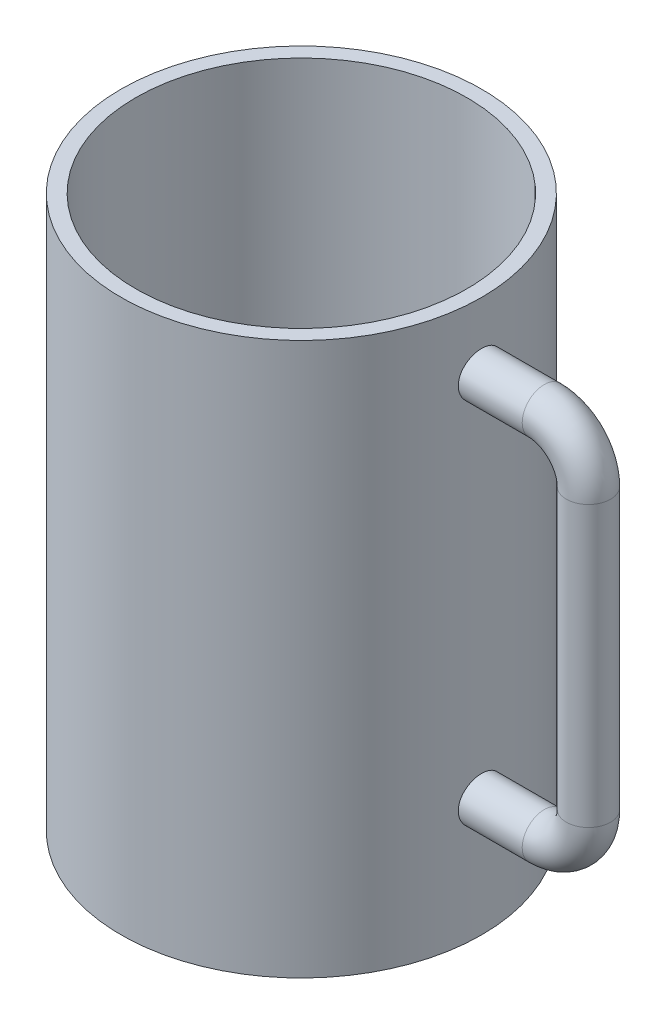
ISO-10303-21;
HEADER;
FILE_DESCRIPTION(('STEP AP214'),'2;1');
FILE_NAME('part.step','',(''),(''),'','','');
FILE_SCHEMA(('AUTOMOTIVE_DESIGN { 1 0 10303 214 1 1 1 1 }'));
ENDSEC;
DATA;
#1=APPLICATION_CONTEXT('core data for automotive mechanical design processes');
#2=APPLICATION_PROTOCOL_DEFINITION('international standard','automotive_design',2000,#1);
#3=PRODUCT_CONTEXT('',#1,'mechanical');
#4=PRODUCT('Part','Part','',(#3));
#5=PRODUCT_RELATED_PRODUCT_CATEGORY('part','',(#4));
#6=PRODUCT_DEFINITION_FORMATION('','',#4);
#7=PRODUCT_DEFINITION_CONTEXT('part definition',#1,'design');
#8=PRODUCT_DEFINITION('design','',#6,#7);
#9=PRODUCT_DEFINITION_SHAPE('','',#8);
#10=(LENGTH_UNIT() NAMED_UNIT(*) SI_UNIT(.MILLI.,.METRE.));
#11=(NAMED_UNIT(*) PLANE_ANGLE_UNIT() SI_UNIT($,.RADIAN.));
#12=(NAMED_UNIT(*) SI_UNIT($,.STERADIAN.) SOLID_ANGLE_UNIT());
#13=UNCERTAINTY_MEASURE_WITH_UNIT(LENGTH_MEASURE(1.E-05),#10,'distance_accuracy_value','');
#14=(GEOMETRIC_REPRESENTATION_CONTEXT(3) GLOBAL_UNCERTAINTY_ASSIGNED_CONTEXT((#13)) GLOBAL_UNIT_ASSIGNED_CONTEXT((#10,
#11,#12)) REPRESENTATION_CONTEXT('',''));
#15=CARTESIAN_POINT('',(0.,0.,0.));
#16=DIRECTION('',(0.,0.,1.));
#17=DIRECTION('',(1.,0.,0.));
#18=AXIS2_PLACEMENT_3D('',#15,#16,#17);
#19=CARTESIAN_POINT('',(10.,-12.,0.));
#20=DIRECTION('',(0.,1.,0.));
#21=DIRECTION('',(-1.,0.,0.));
#22=AXIS2_PLACEMENT_3D('',#19,#20,#21);
#23=CYLINDRICAL_SURFACE('',#22,49.);
#24=CARTESIAN_POINT('',(59.,6.00000000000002,0.));
#25=CARTESIAN_POINT('',(59.0000006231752,5.99999810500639,0.167896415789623));
#26=CARTESIAN_POINT('',(58.9991353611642,6.00704983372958,0.335764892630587));
#27=CARTESIAN_POINT('',(58.9956998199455,6.0352027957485,0.670355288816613));
#28=CARTESIAN_POINT('',(58.9931291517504,6.05630723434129,0.837076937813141));
#29=CARTESIAN_POINT('',(58.9863516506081,6.11243508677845,1.16825140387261));
#30=CARTESIAN_POINT('',(58.9821435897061,6.14746894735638,1.33270242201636));
#31=CARTESIAN_POINT('',(58.9722084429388,6.23121089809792,1.6581031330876));
#32=CARTESIAN_POINT('',(58.9664808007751,6.27992399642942,1.81905152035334));
#33=CARTESIAN_POINT('',(58.9536751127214,6.39060407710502,2.1360800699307));
#34=CARTESIAN_POINT('',(58.9465984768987,6.45255722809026,2.29216511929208));
#35=CARTESIAN_POINT('',(58.9312865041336,6.58932393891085,2.59860492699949));
#36=CARTESIAN_POINT('',(58.923050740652,6.66414223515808,2.74895754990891));
#37=CARTESIAN_POINT('',(58.9056577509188,6.82604306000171,3.04274296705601));
#38=CARTESIAN_POINT('',(58.8965010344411,6.91311881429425,3.1861795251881));
#39=CARTESIAN_POINT('',(58.87751434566,7.09898433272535,3.46528019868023));
#40=CARTESIAN_POINT('',(58.8676841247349,7.19777843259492,3.60094140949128));
#41=CARTESIAN_POINT('',(58.8475839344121,7.40681779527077,3.86406954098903));
#42=CARTESIAN_POINT('',(58.8373122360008,7.51711106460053,3.99149819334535));
#43=CARTESIAN_POINT('',(58.8166546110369,7.74805974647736,4.23667043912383));
#44=CARTESIAN_POINT('',(58.806268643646,7.86871897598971,4.35441043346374));
#45=CARTESIAN_POINT('',(58.7856824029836,8.11948291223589,4.57929490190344));
#46=CARTESIAN_POINT('',(58.7754820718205,8.24958460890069,4.68644272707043));
#47=CARTESIAN_POINT('',(58.7555483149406,8.51841094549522,4.88947037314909));
#48=CARTESIAN_POINT('',(58.7458150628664,8.6571387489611,4.98534602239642));
#49=CARTESIAN_POINT('',(58.7270690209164,8.94261658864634,5.16536176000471));
#50=CARTESIAN_POINT('',(58.7180583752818,9.08938847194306,5.249467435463));
#51=CARTESIAN_POINT('',(58.701043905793,9.38960715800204,5.40503915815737));
#52=CARTESIAN_POINT('',(58.6930404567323,9.54305641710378,5.47650050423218));
#53=CARTESIAN_POINT('',(58.6782786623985,9.85544525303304,5.60619831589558));
#54=CARTESIAN_POINT('',(58.6715198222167,10.0143826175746,5.66444004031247));
#55=CARTESIAN_POINT('',(58.6594352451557,10.3366703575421,5.76732210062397));
#56=CARTESIAN_POINT('',(58.6541100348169,10.500022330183,5.81195743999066));
#57=CARTESIAN_POINT('',(58.6405868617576,10.9931786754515,5.92446822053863));
#58=CARTESIAN_POINT('',(58.6347472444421,11.3280145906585,5.97174750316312));
#59=CARTESIAN_POINT('',(58.6301003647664,12.0007327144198,6.00946361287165));
#60=CARTESIAN_POINT('',(58.6312928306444,12.3386148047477,5.99990263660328));
#61=CARTESIAN_POINT('',(58.6405338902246,13.0061072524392,5.92451461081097));
#62=CARTESIAN_POINT('',(58.648544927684,13.335752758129,5.85899576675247));
#63=CARTESIAN_POINT('',(58.6704651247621,13.9793215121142,5.67401262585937));
#64=CARTESIAN_POINT('',(58.6843743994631,14.2932444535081,5.55454727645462));
#65=CARTESIAN_POINT('',(58.7165656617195,14.8974323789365,5.26473526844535));
#66=CARTESIAN_POINT('',(58.7348591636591,15.1876323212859,5.09425432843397));
#67=CARTESIAN_POINT('',(58.7737489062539,15.7354195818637,4.70734515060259));
#68=CARTESIAN_POINT('',(58.79434524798,15.9930054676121,4.49091489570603));
#69=CARTESIAN_POINT('',(58.8356869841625,16.4700434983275,4.01654107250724));
#70=CARTESIAN_POINT('',(58.8564324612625,16.6892314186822,3.7583317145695));
#71=CARTESIAN_POINT('',(58.8956070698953,17.0811950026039,3.20864521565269));
#72=CARTESIAN_POINT('',(58.9140361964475,17.2539705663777,2.91716800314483));
#73=CARTESIAN_POINT('',(58.9465124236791,17.5482040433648,2.30901834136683));
#74=CARTESIAN_POINT('',(58.9605581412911,17.6696457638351,1.99233797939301));
#75=CARTESIAN_POINT('',(58.9826722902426,17.8575562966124,1.34287005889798));
#76=CARTESIAN_POINT('',(58.9907409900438,17.9240275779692,1.01008322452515));
#77=CARTESIAN_POINT('',(58.9999571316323,17.9997687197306,0.340133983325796));
#78=CARTESIAN_POINT('',(59.0011486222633,18.0094026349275,0.00301331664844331));
#79=CARTESIAN_POINT('',(58.9965949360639,17.9721557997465,-0.668037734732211));
#80=CARTESIAN_POINT('',(58.9908499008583,17.9252762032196,-1.00196818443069));
#81=CARTESIAN_POINT('',(58.9730962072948,17.7766355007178,-1.65608816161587));
#82=CARTESIAN_POINT('',(58.9611073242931,17.6750476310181,-1.9763176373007));
#83=CARTESIAN_POINT('',(58.9322084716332,17.4200538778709,-2.59519442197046));
#84=CARTESIAN_POINT('',(58.9152983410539,17.2666462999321,-2.89384102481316));
#85=CARTESIAN_POINT('',(58.8783331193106,16.9114848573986,-3.46270276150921));
#86=CARTESIAN_POINT('',(58.8582628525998,16.7094950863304,-3.73276960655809));
#87=CARTESIAN_POINT('',(58.8172709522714,16.263236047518,-4.23529766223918));
#88=CARTESIAN_POINT('',(58.7963492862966,16.018965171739,-4.46775744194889));
#89=CARTESIAN_POINT('',(58.7558769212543,15.4934804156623,-4.88976170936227));
#90=CARTESIAN_POINT('',(58.7363343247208,15.2120722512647,-5.07906513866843));
#91=CARTESIAN_POINT('',(58.7009655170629,14.6212287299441,-5.40771700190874));
#92=CARTESIAN_POINT('',(58.6851392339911,14.3117939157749,-5.5470664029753));
#93=CARTESIAN_POINT('',(58.6590478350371,13.6745272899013,-5.77146899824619));
#94=CARTESIAN_POINT('',(58.6487687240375,13.3467441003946,-5.85665893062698));
#95=CARTESIAN_POINT('',(58.6349019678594,12.6812063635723,-5.97074217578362));
#96=CARTESIAN_POINT('',(58.6313140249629,12.3434522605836,-5.99963799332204));
#97=CARTESIAN_POINT('',(58.6312421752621,11.8382471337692,-6.00017546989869));
#98=CARTESIAN_POINT('',(58.6320934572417,11.6705527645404,-5.99329912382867));
#99=CARTESIAN_POINT('',(58.6355076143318,11.3363619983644,-5.96553784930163));
#100=CARTESIAN_POINT('',(58.6380698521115,11.169865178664,-5.94465813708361));
#101=CARTESIAN_POINT('',(58.6448364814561,10.839189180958,-5.88902833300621));
#102=CARTESIAN_POINT('',(58.6490414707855,10.6750108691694,-5.85427319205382));
#103=CARTESIAN_POINT('',(58.6589701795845,10.3502401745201,-5.77116738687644));
#104=CARTESIAN_POINT('',(58.6646933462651,10.1896465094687,-5.722821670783));
#105=CARTESIAN_POINT('',(58.6774961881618,9.87311291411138,-5.61288018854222));
#106=CARTESIAN_POINT('',(58.6845759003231,9.71717311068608,-5.55128406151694));
#107=CARTESIAN_POINT('',(58.6998877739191,9.41109566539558,-5.4153122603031));
#108=CARTESIAN_POINT('',(58.7081195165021,9.26095593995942,-5.34094122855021));
#109=CARTESIAN_POINT('',(58.7255081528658,8.96740645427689,-5.17990471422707));
#110=CARTESIAN_POINT('',(58.734665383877,8.82399917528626,-5.09323474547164));
#111=CARTESIAN_POINT('',(58.7536415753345,8.5450134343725,-4.90826545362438));
#112=CARTESIAN_POINT('',(58.763460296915,8.40943217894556,-4.8099703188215));
#113=CARTESIAN_POINT('',(58.7835556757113,8.14608489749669,-4.60170728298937));
#114=CARTESIAN_POINT('',(58.793834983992,8.01837802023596,-4.49166483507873));
#115=CARTESIAN_POINT('',(58.8144947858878,7.772721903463,-4.26127521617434));
#116=CARTESIAN_POINT('',(58.8248752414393,7.65476914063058,-4.14093179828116));
#117=CARTESIAN_POINT('',(58.8454549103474,7.42932417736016,-3.89066879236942));
#118=CARTESIAN_POINT('',(58.8556540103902,7.32183834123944,-3.76074346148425));
#119=CARTESIAN_POINT('',(58.8755735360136,7.11820152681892,-3.49233604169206));
#120=CARTESIAN_POINT('',(58.885294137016,7.02204637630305,-3.35385713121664));
#121=CARTESIAN_POINT('',(58.9040248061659,6.84134178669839,-3.06868916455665));
#122=CARTESIAN_POINT('',(58.9130318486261,6.75684074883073,-2.92196923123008));
#123=CARTESIAN_POINT('',(58.9300325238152,6.60054463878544,-2.62192418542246));
#124=CARTESIAN_POINT('',(58.9380265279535,6.5287449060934,-2.46860152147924));
#125=CARTESIAN_POINT('',(58.95277171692,6.39838821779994,-2.15650595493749));
#126=CARTESIAN_POINT('',(58.9595238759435,6.33982087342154,-1.99773744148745));
#127=CARTESIAN_POINT('',(58.9715995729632,6.2363032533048,-1.67582486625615));
#128=CARTESIAN_POINT('',(58.9769234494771,6.1913497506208,-1.51268185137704));
#129=CARTESIAN_POINT('',(58.9875304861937,6.10247996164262,-1.12717683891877));
#130=CARTESIAN_POINT('',(58.9921871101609,6.06408923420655,-0.903500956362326));
#131=CARTESIAN_POINT('',(58.998421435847,6.01285062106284,-0.453199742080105));
#132=CARTESIAN_POINT('',(58.9999991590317,6.00000255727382,-0.226574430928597));
#133=CARTESIAN_POINT('',(59.,6.00000000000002,0.));
#134=B_SPLINE_CURVE_WITH_KNOTS('',3,(#24,#25,#26,#27,#28,#29,#30,#31,#32,#33,#34,#35,#36,#37,
#38,#39,#40,#41,#42,#43,#44,#45,#46,#47,#48,#49,#50,#51,#52,#53,#54,#55,#56,#57,#58,#59,#60,#61,
#62,#63,#64,#65,#66,#67,#68,#69,#70,#71,#72,#73,#74,#75,#76,#77,#78,#79,#80,#81,#82,#83,#84,#85,
#86,#87,#88,#89,#90,#91,#92,#93,#94,#95,#96,#97,#98,#99,#100,#101,#102,#103,#104,#105,#106,#107,
#108,#109,#110,#111,#112,#113,#114,#115,#116,#117,#118,#119,#120,#121,#122,#123,#124,#125,#126,
#127,#128,#129,#130,#131,#132,#133),.UNSPECIFIED.,.T.,.F.,(4,2,2,2,2,2,2,2,2,2,2,2,2,2,2,2,2,2,
2,2,2,2,2,2,2,2,2,2,2,2,2,2,2,2,2,2,2,2,2,2,2,2,2,2,2,2,2,2,2,2,2,2,2,2,4),(0.,
0.503490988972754,1.00709685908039,1.51108113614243,2.01525017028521,2.51889507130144,
3.02272579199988,3.52627914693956,4.03001939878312,4.53595393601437,5.04207557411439,
5.54803657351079,6.0541842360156,6.56178215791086,7.06956840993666,7.57715230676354,
8.08492237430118,9.09426654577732,10.103571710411,11.1073533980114,12.1111546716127,
13.1176217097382,14.1241329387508,15.1373191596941,16.1505075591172,17.1640153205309,
18.1774775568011,19.1844412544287,20.1913843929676,21.195157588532,22.198963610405,
23.2077460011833,24.2165667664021,25.2308914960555,26.2451965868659,27.2569305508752,
28.2686194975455,28.7716422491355,29.2744777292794,29.777496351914,30.2803320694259,
30.7831814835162,31.2858485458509,31.7886994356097,32.2913697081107,32.7974443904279,
33.303335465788,33.8095322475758,34.3155420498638,34.8235938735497,35.3314588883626,
35.8389237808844,36.3462682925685,37.0257287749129,37.7051845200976),.UNSPECIFIED.);
#135=CARTESIAN_POINT('',(59.,6.00000000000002,0.));
#136=VERTEX_POINT('',#135);
#137=EDGE_CURVE('E33',#136,#136,#134,.T.);
#138=ORIENTED_EDGE('',*,*,#137,.T.);
#139=EDGE_LOOP('',(#138));
#140=FACE_BOUND('',#139,.T.);
#141=CARTESIAN_POINT('',(10.,-20.,0.));
#142=DIRECTION('',(0.,1.,0.));
#143=DIRECTION('',(-1.,0.,0.));
#144=AXIS2_PLACEMENT_3D('',#141,#142,#143);
#145=CIRCLE('',#144,49.);
#146=CARTESIAN_POINT('',(-39.,-20.,0.));
#147=VERTEX_POINT('',#146);
#148=EDGE_CURVE('E41',#147,#147,#145,.T.);
#149=ORIENTED_EDGE('',*,*,#148,.T.);
#150=EDGE_LOOP('',(#149));
#151=FACE_BOUND('',#150,.T.);
#152=CARTESIAN_POINT('',(9.99999999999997,130.,0.));
#153=DIRECTION('',(0.,1.,0.));
#154=DIRECTION('',(-1.,0.,0.));
#155=AXIS2_PLACEMENT_3D('',#152,#153,#154);
#156=CIRCLE('',#155,49.);
#157=CARTESIAN_POINT('',(-39.,130.,0.));
#158=VERTEX_POINT('',#157);
#159=EDGE_CURVE('E45',#158,#158,#156,.T.);
#160=ORIENTED_EDGE('',*,*,#159,.F.);
#161=EDGE_LOOP('',(#160));
#162=FACE_BOUND('',#161,.T.);
#163=CARTESIAN_POINT('',(59.,106.,0.));
#164=CARTESIAN_POINT('',(59.0000006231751,105.999998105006,-0.167896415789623));
#165=CARTESIAN_POINT('',(58.9991353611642,106.00704983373,-0.335764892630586));
#166=CARTESIAN_POINT('',(58.9956998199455,106.035202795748,-0.670355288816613));
#167=CARTESIAN_POINT('',(58.9931291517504,106.056307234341,-0.837076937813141));
#168=CARTESIAN_POINT('',(58.9863516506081,106.112435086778,-1.16825140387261));
#169=CARTESIAN_POINT('',(58.9821435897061,106.147468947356,-1.33270242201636));
#170=CARTESIAN_POINT('',(58.9722084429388,106.231210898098,-1.6581031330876));
#171=CARTESIAN_POINT('',(58.9664808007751,106.279923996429,-1.81905152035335));
#172=CARTESIAN_POINT('',(58.9536751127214,106.390604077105,-2.1360800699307));
#173=CARTESIAN_POINT('',(58.9465984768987,106.45255722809,-2.29216511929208));
#174=CARTESIAN_POINT('',(58.9312865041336,106.589323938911,-2.59860492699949));
#175=CARTESIAN_POINT('',(58.923050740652,106.664142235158,-2.74895754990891));
#176=CARTESIAN_POINT('',(58.9056577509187,106.826043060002,-3.04274296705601));
#177=CARTESIAN_POINT('',(58.8965010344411,106.913118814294,-3.1861795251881));
#178=CARTESIAN_POINT('',(58.8775143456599,107.098984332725,-3.46528019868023));
#179=CARTESIAN_POINT('',(58.8676841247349,107.197778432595,-3.60094140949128));
#180=CARTESIAN_POINT('',(58.847583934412,107.406817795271,-3.86406954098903));
#181=CARTESIAN_POINT('',(58.8373122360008,107.5171110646,-3.99149819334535));
#182=CARTESIAN_POINT('',(58.8166546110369,107.748059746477,-4.23667043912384));
#183=CARTESIAN_POINT('',(58.806268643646,107.86871897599,-4.35441043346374));
#184=CARTESIAN_POINT('',(58.7856824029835,108.119482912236,-4.57929490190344));
#185=CARTESIAN_POINT('',(58.7754820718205,108.249584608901,-4.68644272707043));
#186=CARTESIAN_POINT('',(58.7555483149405,108.518410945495,-4.88947037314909));
#187=CARTESIAN_POINT('',(58.7458150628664,108.657138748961,-4.98534602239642));
#188=CARTESIAN_POINT('',(58.7270690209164,108.942616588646,-5.16536176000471));
#189=CARTESIAN_POINT('',(58.7180583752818,109.089388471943,-5.24946743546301));
#190=CARTESIAN_POINT('',(58.701043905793,109.389607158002,-5.40503915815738));
#191=CARTESIAN_POINT('',(58.6930404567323,109.543056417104,-5.47650050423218));
#192=CARTESIAN_POINT('',(58.6782786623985,109.855445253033,-5.60619831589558));
#193=CARTESIAN_POINT('',(58.6715198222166,110.014382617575,-5.66444004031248));
#194=CARTESIAN_POINT('',(58.6594352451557,110.336670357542,-5.76732210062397));
#195=CARTESIAN_POINT('',(58.6541100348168,110.500022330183,-5.81195743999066));
#196=CARTESIAN_POINT('',(58.6405868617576,110.993178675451,-5.92446822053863));
#197=CARTESIAN_POINT('',(58.6347472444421,111.328014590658,-5.97174750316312));
#198=CARTESIAN_POINT('',(58.6301003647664,112.00073271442,-6.00946361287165));
#199=CARTESIAN_POINT('',(58.6312928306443,112.338614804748,-5.99990263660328));
#200=CARTESIAN_POINT('',(58.6405338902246,113.006107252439,-5.92451461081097));
#201=CARTESIAN_POINT('',(58.648544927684,113.335752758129,-5.85899576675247));
#202=CARTESIAN_POINT('',(58.6704651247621,113.979321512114,-5.67401262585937));
#203=CARTESIAN_POINT('',(58.6843743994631,114.293244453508,-5.55454727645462));
#204=CARTESIAN_POINT('',(58.7165656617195,114.897432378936,-5.26473526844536));
#205=CARTESIAN_POINT('',(58.7348591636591,115.187632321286,-5.09425432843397));
#206=CARTESIAN_POINT('',(58.7737489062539,115.735419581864,-4.70734515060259));
#207=CARTESIAN_POINT('',(58.7943452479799,115.993005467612,-4.49091489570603));
#208=CARTESIAN_POINT('',(58.8356869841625,116.470043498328,-4.01654107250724));
#209=CARTESIAN_POINT('',(58.8564324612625,116.689231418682,-3.7583317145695));
#210=CARTESIAN_POINT('',(58.8956070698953,117.081195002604,-3.20864521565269));
#211=CARTESIAN_POINT('',(58.9140361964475,117.253970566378,-2.91716800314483));
#212=CARTESIAN_POINT('',(58.946512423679,117.548204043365,-2.30901834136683));
#213=CARTESIAN_POINT('',(58.9605581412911,117.669645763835,-1.99233797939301));
#214=CARTESIAN_POINT('',(58.9826722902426,117.857556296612,-1.34287005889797));
#215=CARTESIAN_POINT('',(58.9907409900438,117.924027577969,-1.01008322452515));
#216=CARTESIAN_POINT('',(58.9999571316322,117.999768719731,-0.34013398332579));
#217=CARTESIAN_POINT('',(59.0011486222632,118.009402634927,-0.00301331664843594));
#218=CARTESIAN_POINT('',(58.9965949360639,117.972155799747,0.668037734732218));
#219=CARTESIAN_POINT('',(58.9908499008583,117.92527620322,1.00196818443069));
#220=CARTESIAN_POINT('',(58.9730962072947,117.776635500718,1.65608816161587));
#221=CARTESIAN_POINT('',(58.9611073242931,117.675047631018,1.9763176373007));
#222=CARTESIAN_POINT('',(58.9322084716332,117.420053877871,2.59519442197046));
#223=CARTESIAN_POINT('',(58.9152983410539,117.266646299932,2.89384102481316));
#224=CARTESIAN_POINT('',(58.8783331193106,116.911484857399,3.46270276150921));
#225=CARTESIAN_POINT('',(58.8582628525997,116.70949508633,3.73276960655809));
#226=CARTESIAN_POINT('',(58.8172709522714,116.263236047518,4.23529766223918));
#227=CARTESIAN_POINT('',(58.7963492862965,116.018965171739,4.46775744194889));
#228=CARTESIAN_POINT('',(58.7558769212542,115.493480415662,4.88976170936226));
#229=CARTESIAN_POINT('',(58.7363343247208,115.212072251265,5.07906513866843));
#230=CARTESIAN_POINT('',(58.7009655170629,114.621228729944,5.40771700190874));
#231=CARTESIAN_POINT('',(58.6851392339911,114.311793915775,5.5470664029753));
#232=CARTESIAN_POINT('',(58.6590478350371,113.674527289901,5.77146899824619));
#233=CARTESIAN_POINT('',(58.6487687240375,113.346744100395,5.85665893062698));
#234=CARTESIAN_POINT('',(58.6349019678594,112.681206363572,5.97074217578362));
#235=CARTESIAN_POINT('',(58.6313140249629,112.343452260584,5.99963799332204));
#236=CARTESIAN_POINT('',(58.6312421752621,111.838247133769,6.00017546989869));
#237=CARTESIAN_POINT('',(58.6320934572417,111.67055276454,5.99329912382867));
#238=CARTESIAN_POINT('',(58.6355076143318,111.336361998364,5.96553784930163));
#239=CARTESIAN_POINT('',(58.6380698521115,111.169865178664,5.94465813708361));
#240=CARTESIAN_POINT('',(58.6448364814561,110.839189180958,5.88902833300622));
#241=CARTESIAN_POINT('',(58.6490414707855,110.675010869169,5.85427319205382));
#242=CARTESIAN_POINT('',(58.6589701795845,110.35024017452,5.77116738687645));
#243=CARTESIAN_POINT('',(58.6646933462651,110.189646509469,5.722821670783));
#244=CARTESIAN_POINT('',(58.6774961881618,109.873112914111,5.61288018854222));
#245=CARTESIAN_POINT('',(58.684575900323,109.717173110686,5.55128406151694));
#246=CARTESIAN_POINT('',(58.6998877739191,109.411095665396,5.4153122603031));
#247=CARTESIAN_POINT('',(58.7081195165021,109.260955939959,5.3409412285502));
#248=CARTESIAN_POINT('',(58.7255081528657,108.967406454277,5.17990471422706));
#249=CARTESIAN_POINT('',(58.734665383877,108.823999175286,5.09323474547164));
#250=CARTESIAN_POINT('',(58.7536415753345,108.545013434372,4.90826545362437));
#251=CARTESIAN_POINT('',(58.763460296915,108.409432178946,4.80997031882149));
#252=CARTESIAN_POINT('',(58.7835556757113,108.146084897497,4.60170728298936));
#253=CARTESIAN_POINT('',(58.793834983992,108.018378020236,4.49166483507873));
#254=CARTESIAN_POINT('',(58.8144947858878,107.772721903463,4.26127521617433));
#255=CARTESIAN_POINT('',(58.8248752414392,107.654769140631,4.14093179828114));
#256=CARTESIAN_POINT('',(58.8454549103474,107.42932417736,3.8906687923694));
#257=CARTESIAN_POINT('',(58.8556540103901,107.321838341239,3.76074346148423));
#258=CARTESIAN_POINT('',(58.8755735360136,107.118201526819,3.49233604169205));
#259=CARTESIAN_POINT('',(58.885294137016,107.022046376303,3.35385713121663));
#260=CARTESIAN_POINT('',(58.9040248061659,106.841341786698,3.06868916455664));
#261=CARTESIAN_POINT('',(58.9130318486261,106.756840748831,2.92196923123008));
#262=CARTESIAN_POINT('',(58.9300325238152,106.600544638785,2.62192418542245));
#263=CARTESIAN_POINT('',(58.9380265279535,106.528744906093,2.46860152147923));
#264=CARTESIAN_POINT('',(58.95277171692,106.3983882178,2.15650595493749));
#265=CARTESIAN_POINT('',(58.9595238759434,106.339820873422,1.99773744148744));
#266=CARTESIAN_POINT('',(58.9715995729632,106.236303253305,1.67582486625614));
#267=CARTESIAN_POINT('',(58.976923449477,106.191349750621,1.51268185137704));
#268=CARTESIAN_POINT('',(58.9875304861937,106.102479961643,1.12717683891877));
#269=CARTESIAN_POINT('',(58.9921871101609,106.064089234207,0.903500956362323));
#270=CARTESIAN_POINT('',(58.998421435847,106.012850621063,0.453199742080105));
#271=CARTESIAN_POINT('',(58.9999991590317,106.000002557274,0.226574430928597));
#272=CARTESIAN_POINT('',(59.,106.,0.));
#273=B_SPLINE_CURVE_WITH_KNOTS('',3,(#163,#164,#165,#166,#167,#168,#169,#170,#171,#172,#173,
#174,#175,#176,#177,#178,#179,#180,#181,#182,#183,#184,#185,#186,#187,#188,#189,#190,#191,#192,
#193,#194,#195,#196,#197,#198,#199,#200,#201,#202,#203,#204,#205,#206,#207,#208,#209,#210,#211,
#212,#213,#214,#215,#216,#217,#218,#219,#220,#221,#222,#223,#224,#225,#226,#227,#228,#229,#230,
#231,#232,#233,#234,#235,#236,#237,#238,#239,#240,#241,#242,#243,#244,#245,#246,#247,#248,#249,
#250,#251,#252,#253,#254,#255,#256,#257,#258,#259,#260,#261,#262,#263,#264,#265,#266,#267,#268,
#269,#270,#271,#272),.UNSPECIFIED.,.T.,.F.,(4,2,2,2,2,2,2,2,2,2,2,2,2,2,2,2,2,2,2,2,2,2,2,2,2,2,
2,2,2,2,2,2,2,2,2,2,2,2,2,2,2,2,2,2,2,2,2,2,2,2,2,2,2,2,4),(0.,0.503490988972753,
1.00709685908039,1.51108113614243,2.01525017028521,2.51889507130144,3.02272579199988,
3.52627914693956,4.03001939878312,4.53595393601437,5.04207557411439,5.54803657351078,
6.05418423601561,6.56178215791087,7.06956840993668,7.57715230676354,8.08492237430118,
9.09426654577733,10.103571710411,11.1073533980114,12.1111546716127,13.1176217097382,
14.1241329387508,15.1373191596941,16.1505075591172,17.1640153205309,18.1774775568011,
19.1844412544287,20.1913843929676,21.195157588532,22.198963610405,23.2077460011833,
24.2165667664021,25.2308914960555,26.2451965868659,27.2569305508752,28.2686194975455,
28.7716422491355,29.2744777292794,29.7774963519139,30.2803320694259,30.7831814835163,
31.2858485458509,31.7886994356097,32.2913697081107,32.7974443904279,33.3033354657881,
33.8095322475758,34.3155420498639,34.8235938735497,35.3314588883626,35.8389237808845,
36.3462682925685,37.0257287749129,37.7051845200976),.UNSPECIFIED.);
#274=CARTESIAN_POINT('',(59.,106.,0.));
#275=VERTEX_POINT('',#274);
#276=EDGE_CURVE('E10',#275,#275,#273,.T.);
#277=ORIENTED_EDGE('',*,*,#276,.F.);
#278=EDGE_LOOP('',(#277));
#279=FACE_BOUND('',#278,.T.);
#280=ADVANCED_FACE('F29',(#140,#151,#162,#279),#23,.T.);
#281=CARTESIAN_POINT('',(55.,-12.,0.));
#282=DIRECTION('',(0.,-1.,0.));
#283=DIRECTION('',(1.,0.,0.));
#284=AXIS2_PLACEMENT_3D('',#281,#282,#283);
#285=PLANE('',#284);
#286=CARTESIAN_POINT('',(10.,-12.,0.));
#287=DIRECTION('',(0.,1.,0.));
#288=DIRECTION('',(-1.,0.,0.));
#289=AXIS2_PLACEMENT_3D('',#286,#287,#288);
#290=CIRCLE('',#289,45.);
#291=CARTESIAN_POINT('',(-35.,-12.,0.));
#292=VERTEX_POINT('',#291);
#293=EDGE_CURVE('E103',#292,#292,#290,.T.);
#294=ORIENTED_EDGE('',*,*,#293,.T.);
#295=EDGE_LOOP('',(#294));
#296=FACE_BOUND('',#295,.T.);
#297=ADVANCED_FACE('F31',(#296),#285,.F.);
#298=CARTESIAN_POINT('',(10.,-20.,0.));
#299=DIRECTION('',(0.,1.,0.));
#300=DIRECTION('',(-1.,0.,0.));
#301=AXIS2_PLACEMENT_3D('',#298,#299,#300);
#302=PLANE('',#301);
#303=ORIENTED_EDGE('',*,*,#148,.F.);
#304=EDGE_LOOP('',(#303));
#305=FACE_BOUND('',#304,.T.);
#306=ADVANCED_FACE('F79',(#305),#302,.F.);
#307=CARTESIAN_POINT('',(59.,130.,0.));
#308=DIRECTION('',(0.,-1.,0.));
#309=DIRECTION('',(1.,0.,0.));
#310=AXIS2_PLACEMENT_3D('',#307,#308,#309);
#311=PLANE('',#310);
#312=CARTESIAN_POINT('',(9.99999999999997,130.,0.));
#313=DIRECTION('',(0.,1.,0.));
#314=DIRECTION('',(-1.,0.,0.));
#315=AXIS2_PLACEMENT_3D('',#312,#313,#314);
#316=CIRCLE('',#315,45.);
#317=CARTESIAN_POINT('',(-35.,130.,0.));
#318=VERTEX_POINT('',#317);
#319=EDGE_CURVE('E101',#318,#318,#316,.T.);
#320=ORIENTED_EDGE('',*,*,#319,.F.);
#321=EDGE_LOOP('',(#320));
#322=FACE_BOUND('',#321,.T.);
#323=ORIENTED_EDGE('',*,*,#159,.T.);
#324=EDGE_LOOP('',(#323));
#325=FACE_BOUND('',#324,.T.);
#326=ADVANCED_FACE('F76',(#322,#325),#311,.F.);
#327=CARTESIAN_POINT('',(10.,-12.,0.));
#328=DIRECTION('',(0.,1.,0.));
#329=DIRECTION('',(-1.,0.,0.));
#330=AXIS2_PLACEMENT_3D('',#327,#328,#329);
#331=CYLINDRICAL_SURFACE('',#330,45.);
#332=ORIENTED_EDGE('',*,*,#293,.F.);
#333=EDGE_LOOP('',(#332));
#334=FACE_BOUND('',#333,.T.);
#335=ORIENTED_EDGE('',*,*,#319,.T.);
#336=EDGE_LOOP('',(#335));
#337=FACE_BOUND('',#336,.T.);
#338=ADVANCED_FACE('F73',(#334,#337),#331,.F.);
#339=CARTESIAN_POINT('',(76.,12.,0.));
#340=DIRECTION('',(-1.,0.,0.));
#341=DIRECTION('',(0.,-1.,0.));
#342=AXIS2_PLACEMENT_3D('',#339,#340,#341);
#343=CYLINDRICAL_SURFACE('',#342,6.);
#344=CARTESIAN_POINT('',(76.,12.,0.));
#345=DIRECTION('',(-1.,0.,0.));
#346=DIRECTION('',(0.,0.,-1.));
#347=AXIS2_PLACEMENT_3D('',#344,#345,#346);
#348=CIRCLE('',#347,6.);
#349=CARTESIAN_POINT('',(76.,6.00000000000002,0.));
#350=VERTEX_POINT('',#349);
#351=EDGE_CURVE('E108',#350,#350,#348,.T.);
#352=ORIENTED_EDGE('',*,*,#351,.T.);
#353=EDGE_LOOP('',(#352));
#354=FACE_BOUND('',#353,.T.);
#355=ORIENTED_EDGE('',*,*,#137,.F.);
#356=EDGE_LOOP('',(#355));
#357=FACE_BOUND('',#356,.T.);
#358=ADVANCED_FACE('F58',(#354,#357),#343,.T.);
#359=CARTESIAN_POINT('',(76.,112.,0.));
#360=DIRECTION('',(-1.,0.,0.));
#361=DIRECTION('',(0.,-1.,0.));
#362=AXIS2_PLACEMENT_3D('',#359,#360,#361);
#363=CYLINDRICAL_SURFACE('',#362,6.);
#364=CARTESIAN_POINT('',(76.,112.,0.));
#365=DIRECTION('',(1.,0.,0.));
#366=DIRECTION('',(0.,0.,-1.));
#367=AXIS2_PLACEMENT_3D('',#364,#365,#366);
#368=CIRCLE('',#367,6.);
#369=CARTESIAN_POINT('',(76.,118.,0.));
#370=VERTEX_POINT('',#369);
#371=EDGE_CURVE('E117',#370,#370,#368,.T.);
#372=ORIENTED_EDGE('',*,*,#371,.F.);
#373=EDGE_LOOP('',(#372));
#374=FACE_BOUND('',#373,.T.);
#375=ORIENTED_EDGE('',*,*,#276,.T.);
#376=EDGE_LOOP('',(#375));
#377=FACE_BOUND('',#376,.T.);
#378=ADVANCED_FACE('F53',(#374,#377),#363,.T.);
#379=CARTESIAN_POINT('',(76.,24.,0.));
#380=DIRECTION('',(0.,0.,-1.));
#381=DIRECTION('',(-1.,0.,0.));
#382=AXIS2_PLACEMENT_3D('',#379,#380,#381);
#383=TOROIDAL_SURFACE('',#382,12.,6.);
#384=CARTESIAN_POINT('',(88.,24.,0.));
#385=DIRECTION('',(0.,-1.,0.));
#386=DIRECTION('',(0.,0.,-1.));
#387=AXIS2_PLACEMENT_3D('',#384,#385,#386);
#388=CIRCLE('',#387,6.);
#389=CARTESIAN_POINT('',(94.,24.,0.));
#390=VERTEX_POINT('',#389);
#391=EDGE_CURVE('E111',#390,#390,#388,.T.);
#392=CARTESIAN_POINT('',(76.,24.,0.));
#393=DIRECTION('',(0.,0.,-1.));
#394=DIRECTION('',(-1.,0.,0.));
#395=AXIS2_PLACEMENT_3D('',#392,#393,#394);
#396=CIRCLE('',#395,18.);
#397=EDGE_CURVE('',#390,#350,#396,.T.);
#398=ORIENTED_EDGE('',*,*,#391,.T.);
#399=ORIENTED_EDGE('',*,*,#351,.F.);
#400=ORIENTED_EDGE('',*,*,#397,.T.);
#401=ORIENTED_EDGE('',*,*,#397,.F.);
#402=EDGE_LOOP('',(#398,#400,#399,#401));
#403=FACE_BOUND('',#402,.T.);
#404=ADVANCED_FACE('F57',(#403),#383,.T.);
#405=CARTESIAN_POINT('',(88.,100.,0.));
#406=DIRECTION('',(0.,-1.,0.));
#407=DIRECTION('',(0.,0.,-1.));
#408=AXIS2_PLACEMENT_3D('',#405,#406,#407);
#409=CYLINDRICAL_SURFACE('',#408,6.);
#410=CARTESIAN_POINT('',(88.,100.,0.));
#411=DIRECTION('',(0.,-1.,0.));
#412=DIRECTION('',(0.,0.,-1.));
#413=AXIS2_PLACEMENT_3D('',#410,#411,#412);
#414=CIRCLE('',#413,6.);
#415=CARTESIAN_POINT('',(94.,100.,0.));
#416=VERTEX_POINT('',#415);
#417=EDGE_CURVE('E114',#416,#416,#414,.T.);
#418=ORIENTED_EDGE('',*,*,#417,.T.);
#419=EDGE_LOOP('',(#418));
#420=FACE_BOUND('',#419,.T.);
#421=ORIENTED_EDGE('',*,*,#391,.F.);
#422=EDGE_LOOP('',(#421));
#423=FACE_BOUND('',#422,.T.);
#424=ADVANCED_FACE('F63',(#420,#423),#409,.T.);
#425=CARTESIAN_POINT('',(76.,100.,0.));
#426=DIRECTION('',(0.,0.,-1.));
#427=DIRECTION('',(-1.,0.,0.));
#428=AXIS2_PLACEMENT_3D('',#425,#426,#427);
#429=TOROIDAL_SURFACE('',#428,12.,6.);
#430=CARTESIAN_POINT('',(76.,100.,0.));
#431=DIRECTION('',(0.,0.,-1.));
#432=DIRECTION('',(-1.,0.,0.));
#433=AXIS2_PLACEMENT_3D('',#430,#431,#432);
#434=CIRCLE('',#433,18.);
#435=EDGE_CURVE('',#370,#416,#434,.T.);
#436=ORIENTED_EDGE('',*,*,#371,.T.);
#437=ORIENTED_EDGE('',*,*,#417,.F.);
#438=ORIENTED_EDGE('',*,*,#435,.T.);
#439=ORIENTED_EDGE('',*,*,#435,.F.);
#440=EDGE_LOOP('',(#436,#438,#437,#439));
#441=FACE_BOUND('',#440,.T.);
#442=ADVANCED_FACE('F60',(#441),#429,.T.);
#443=CLOSED_SHELL('',(#280,#297,#306,#326,#338,#358,#378,#404,#424,#442));
#444=MANIFOLD_SOLID_BREP('B2',#443);
#445=ADVANCED_BREP_SHAPE_REPRESENTATION('',(#18,#444),#14);
#446=SHAPE_DEFINITION_REPRESENTATION(#9,#445);
ENDSEC;
END-ISO-10303-21;
